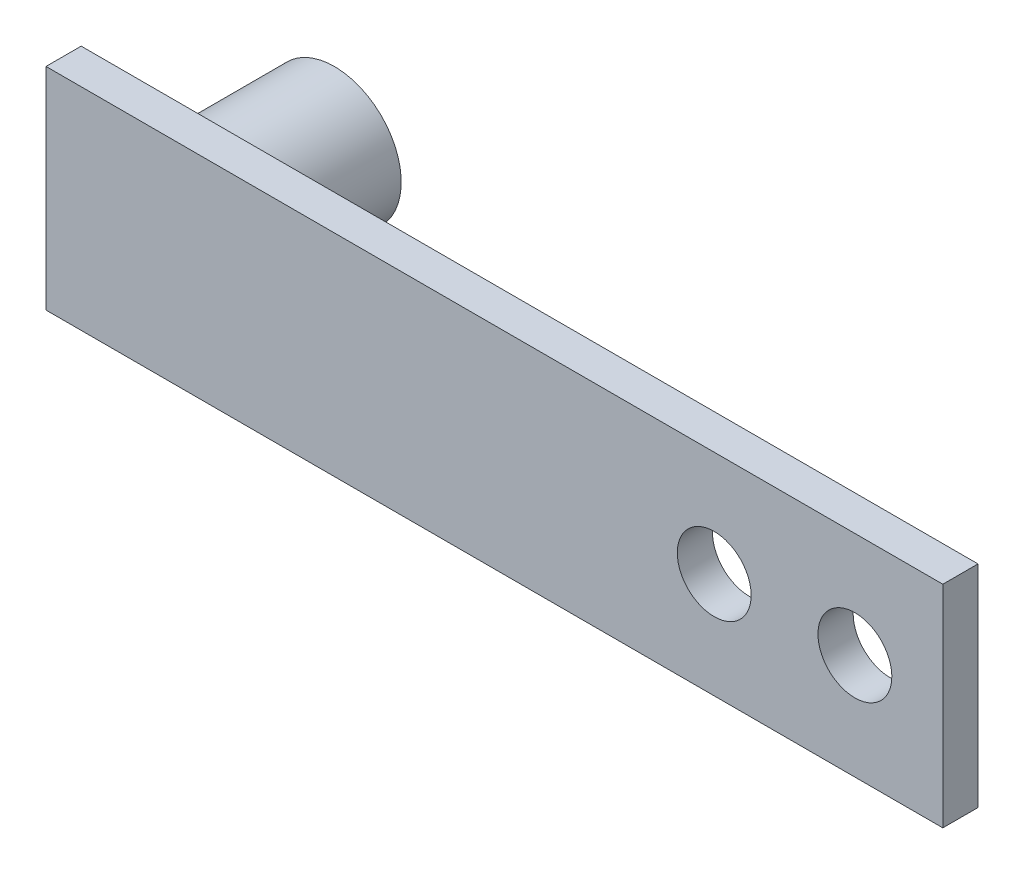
ISO-10303-21;
HEADER;
FILE_DESCRIPTION(('STEP AP214'),'2;1');
FILE_NAME('part.step','',(''),(''),'','','');
FILE_SCHEMA(('AUTOMOTIVE_DESIGN { 1 0 10303 214 1 1 1 1 }'));
ENDSEC;
DATA;
#1=APPLICATION_CONTEXT('core data for automotive mechanical design processes');
#2=APPLICATION_PROTOCOL_DEFINITION('international standard','automotive_design',2000,#1);
#3=PRODUCT_CONTEXT('',#1,'mechanical');
#4=PRODUCT('Part','Part','',(#3));
#5=PRODUCT_RELATED_PRODUCT_CATEGORY('part','',(#4));
#6=PRODUCT_DEFINITION_FORMATION('','',#4);
#7=PRODUCT_DEFINITION_CONTEXT('part definition',#1,'design');
#8=PRODUCT_DEFINITION('design','',#6,#7);
#9=PRODUCT_DEFINITION_SHAPE('','',#8);
#10=(LENGTH_UNIT() NAMED_UNIT(*) SI_UNIT(.MILLI.,.METRE.));
#11=(NAMED_UNIT(*) PLANE_ANGLE_UNIT() SI_UNIT($,.RADIAN.));
#12=(NAMED_UNIT(*) SI_UNIT($,.STERADIAN.) SOLID_ANGLE_UNIT());
#13=UNCERTAINTY_MEASURE_WITH_UNIT(LENGTH_MEASURE(1.E-05),#10,'distance_accuracy_value','');
#14=(GEOMETRIC_REPRESENTATION_CONTEXT(3) GLOBAL_UNCERTAINTY_ASSIGNED_CONTEXT((#13)) GLOBAL_UNIT_ASSIGNED_CONTEXT((#10,
#11,#12)) REPRESENTATION_CONTEXT('',''));
#15=CARTESIAN_POINT('',(0.,0.,0.));
#16=DIRECTION('',(0.,0.,1.));
#17=DIRECTION('',(1.,0.,0.));
#18=AXIS2_PLACEMENT_3D('',#15,#16,#17);
#19=CARTESIAN_POINT('',(0.,0.,20.));
#20=DIRECTION('',(0.,0.,-1.));
#21=DIRECTION('',(-1.,0.,0.));
#22=AXIS2_PLACEMENT_3D('',#19,#20,#21);
#23=PLANE('',#22);
#24=CARTESIAN_POINT('',(0.,0.,20.));
#25=DIRECTION('',(0.,0.,-1.));
#26=DIRECTION('',(-1.,0.,0.));
#27=AXIS2_PLACEMENT_3D('',#24,#25,#26);
#28=CIRCLE('',#27,9.5);
#29=CARTESIAN_POINT('',(-9.5,0.,20.));
#30=VERTEX_POINT('',#29);
#31=CARTESIAN_POINT('',(0.,9.5,20.));
#32=VERTEX_POINT('',#31);
#33=EDGE_CURVE('E25',#30,#32,#28,.T.);
#34=ORIENTED_EDGE('',*,*,#33,.F.);
#35=DIRECTION('',(0.,-1.,0.));
#36=VECTOR('',#35,1.);
#37=CARTESIAN_POINT('',(-9.5,9.5,20.));
#38=LINE('',#37,#36);
#39=CARTESIAN_POINT('',(-9.5,9.5,20.));
#40=VERTEX_POINT('',#39);
#41=EDGE_CURVE('E96',#40,#30,#38,.T.);
#42=ORIENTED_EDGE('',*,*,#41,.F.);
#43=DIRECTION('',(-1.,0.,0.));
#44=VECTOR('',#43,1.);
#45=CARTESIAN_POINT('',(9.5,9.5,20.));
#46=LINE('',#45,#44);
#47=EDGE_CURVE('E112',#32,#40,#46,.T.);
#48=ORIENTED_EDGE('',*,*,#47,.F.);
#49=EDGE_LOOP('',(#34,#42,#48));
#50=FACE_BOUND('',#49,.T.);
#51=ADVANCED_FACE('F14',(#50),#23,.T.);
#52=CARTESIAN_POINT('',(9.5,0.,20.));
#53=VERTEX_POINT('',#52);
#54=EDGE_CURVE('E9',#32,#53,#28,.T.);
#55=ORIENTED_EDGE('',*,*,#54,.F.);
#56=CARTESIAN_POINT('',(9.5,9.5,20.));
#57=VERTEX_POINT('',#56);
#58=EDGE_CURVE('E110',#57,#32,#46,.T.);
#59=ORIENTED_EDGE('',*,*,#58,.F.);
#60=DIRECTION('',(0.,1.,0.));
#61=VECTOR('',#60,1.);
#62=CARTESIAN_POINT('',(9.5,9.5,20.));
#63=LINE('',#62,#61);
#64=EDGE_CURVE('E175',#53,#57,#63,.T.);
#65=ORIENTED_EDGE('',*,*,#64,.F.);
#66=EDGE_LOOP('',(#55,#59,#65));
#67=FACE_BOUND('',#66,.T.);
#68=ADVANCED_FACE('F195',(#67),#23,.T.);
#69=CARTESIAN_POINT('',(0.,-9.5,20.));
#70=VERTEX_POINT('',#69);
#71=EDGE_CURVE('E23',#53,#70,#28,.T.);
#72=ORIENTED_EDGE('',*,*,#71,.F.);
#73=CARTESIAN_POINT('',(9.5,-9.5,20.));
#74=VERTEX_POINT('',#73);
#75=EDGE_CURVE('E163',#74,#53,#63,.T.);
#76=ORIENTED_EDGE('',*,*,#75,.F.);
#77=DIRECTION('',(1.,0.,0.));
#78=VECTOR('',#77,1.);
#79=CARTESIAN_POINT('',(9.5,-9.5,20.));
#80=LINE('',#79,#78);
#81=EDGE_CURVE('E104',#70,#74,#80,.T.);
#82=ORIENTED_EDGE('',*,*,#81,.F.);
#83=EDGE_LOOP('',(#72,#76,#82));
#84=FACE_BOUND('',#83,.T.);
#85=ADVANCED_FACE('F196',(#84),#23,.T.);
#86=CARTESIAN_POINT('',(9.5,9.5,21.));
#87=DIRECTION('',(0.,-1.,0.));
#88=DIRECTION('',(0.,0.,-1.));
#89=AXIS2_PLACEMENT_3D('',#86,#87,#88);
#90=PLANE('',#89);
#91=ORIENTED_EDGE('',*,*,#58,.T.);
#92=ORIENTED_EDGE('',*,*,#47,.T.);
#93=DIRECTION('',(0.,0.,-1.));
#94=VECTOR('',#93,1.);
#95=CARTESIAN_POINT('',(-9.5,9.5,21.));
#96=LINE('',#95,#94);
#97=CARTESIAN_POINT('',(-9.5,9.5,21.));
#98=VERTEX_POINT('',#97);
#99=EDGE_CURVE('E100',#98,#40,#96,.T.);
#100=ORIENTED_EDGE('',*,*,#99,.F.);
#101=DIRECTION('',(-1.,0.,0.));
#102=VECTOR('',#101,1.);
#103=CARTESIAN_POINT('',(9.5,9.5,21.));
#104=LINE('',#103,#102);
#105=CARTESIAN_POINT('',(9.5,9.5,21.));
#106=VERTEX_POINT('',#105);
#107=EDGE_CURVE('E159',#106,#98,#104,.T.);
#108=ORIENTED_EDGE('',*,*,#107,.F.);
#109=DIRECTION('',(0.,0.,-1.));
#110=VECTOR('',#109,1.);
#111=CARTESIAN_POINT('',(9.5,9.5,21.));
#112=LINE('',#111,#110);
#113=EDGE_CURVE('E172',#106,#57,#112,.T.);
#114=ORIENTED_EDGE('',*,*,#113,.T.);
#115=EDGE_LOOP('',(#91,#92,#100,#108,#114));
#116=FACE_BOUND('',#115,.T.);
#117=ADVANCED_FACE('F16',(#116),#90,.F.);
#118=CARTESIAN_POINT('',(-9.5,9.5,21.));
#119=DIRECTION('',(1.,0.,0.));
#120=DIRECTION('',(0.,0.,1.));
#121=AXIS2_PLACEMENT_3D('',#118,#119,#120);
#122=PLANE('',#121);
#123=ORIENTED_EDGE('',*,*,#41,.T.);
#124=CARTESIAN_POINT('',(-9.5,-9.5,20.));
#125=VERTEX_POINT('',#124);
#126=EDGE_CURVE('E98',#30,#125,#38,.T.);
#127=ORIENTED_EDGE('',*,*,#126,.T.);
#128=DIRECTION('',(0.,0.,-1.));
#129=VECTOR('',#128,1.);
#130=CARTESIAN_POINT('',(-9.5,-9.5,21.));
#131=LINE('',#130,#129);
#132=CARTESIAN_POINT('',(-9.5,-9.5,21.));
#133=VERTEX_POINT('',#132);
#134=EDGE_CURVE('E117',#133,#125,#131,.T.);
#135=ORIENTED_EDGE('',*,*,#134,.F.);
#136=DIRECTION('',(0.,-1.,0.));
#137=VECTOR('',#136,1.);
#138=CARTESIAN_POINT('',(-9.5,9.5,21.));
#139=LINE('',#138,#137);
#140=EDGE_CURVE('E162',#98,#133,#139,.T.);
#141=ORIENTED_EDGE('',*,*,#140,.F.);
#142=ORIENTED_EDGE('',*,*,#99,.T.);
#143=EDGE_LOOP('',(#123,#127,#135,#141,#142));
#144=FACE_BOUND('',#143,.T.);
#145=ADVANCED_FACE('F97',(#144),#122,.F.);
#146=CARTESIAN_POINT('',(9.5,-9.5,21.));
#147=DIRECTION('',(0.,1.,0.));
#148=DIRECTION('',(-1.,0.,0.));
#149=AXIS2_PLACEMENT_3D('',#146,#147,#148);
#150=PLANE('',#149);
#151=EDGE_CURVE('E108',#125,#70,#80,.T.);
#152=ORIENTED_EDGE('',*,*,#151,.T.);
#153=ORIENTED_EDGE('',*,*,#81,.T.);
#154=DIRECTION('',(0.,0.,-1.));
#155=VECTOR('',#154,1.);
#156=CARTESIAN_POINT('',(9.5,-9.5,21.));
#157=LINE('',#156,#155);
#158=CARTESIAN_POINT('',(9.5,-9.5,21.));
#159=VERTEX_POINT('',#158);
#160=EDGE_CURVE('E180',#159,#74,#157,.T.);
#161=ORIENTED_EDGE('',*,*,#160,.F.);
#162=DIRECTION('',(1.,0.,0.));
#163=VECTOR('',#162,1.);
#164=CARTESIAN_POINT('',(9.5,-9.5,21.));
#165=LINE('',#164,#163);
#166=EDGE_CURVE('E166',#133,#159,#165,.T.);
#167=ORIENTED_EDGE('',*,*,#166,.F.);
#168=ORIENTED_EDGE('',*,*,#134,.T.);
#169=EDGE_LOOP('',(#152,#153,#161,#167,#168));
#170=FACE_BOUND('',#169,.T.);
#171=ADVANCED_FACE('F185',(#170),#150,.F.);
#172=CARTESIAN_POINT('',(9.5,9.5,21.));
#173=DIRECTION('',(-1.,0.,0.));
#174=DIRECTION('',(0.,-1.,0.));
#175=AXIS2_PLACEMENT_3D('',#172,#173,#174);
#176=PLANE('',#175);
#177=ORIENTED_EDGE('',*,*,#75,.T.);
#178=ORIENTED_EDGE('',*,*,#64,.T.);
#179=ORIENTED_EDGE('',*,*,#113,.F.);
#180=DIRECTION('',(0.,1.,0.));
#181=VECTOR('',#180,1.);
#182=CARTESIAN_POINT('',(9.5,9.5,21.));
#183=LINE('',#182,#181);
#184=EDGE_CURVE('E169',#159,#106,#183,.T.);
#185=ORIENTED_EDGE('',*,*,#184,.F.);
#186=ORIENTED_EDGE('',*,*,#160,.T.);
#187=EDGE_LOOP('',(#177,#178,#179,#185,#186));
#188=FACE_BOUND('',#187,.T.);
#189=ADVANCED_FACE('F192',(#188),#176,.F.);
#190=CARTESIAN_POINT('',(-15.,15.,21.));
#191=DIRECTION('',(0.,0.,1.));
#192=DIRECTION('',(0.,-1.,0.));
#193=AXIS2_PLACEMENT_3D('',#190,#191,#192);
#194=PLANE('',#193);
#195=CARTESIAN_POINT('',(80.,0.,21.));
#196=DIRECTION('',(0.,0.,1.));
#197=DIRECTION('',(0.,-1.,0.));
#198=AXIS2_PLACEMENT_3D('',#195,#196,#197);
#199=CIRCLE('',#198,5.25);
#200=CARTESIAN_POINT('',(80.,-5.25,21.));
#201=VERTEX_POINT('',#200);
#202=EDGE_CURVE('E123',#201,#201,#199,.T.);
#203=ORIENTED_EDGE('',*,*,#202,.T.);
#204=EDGE_LOOP('',(#203));
#205=FACE_BOUND('',#204,.T.);
#206=CARTESIAN_POINT('',(100.,0.,21.));
#207=DIRECTION('',(0.,0.,1.));
#208=DIRECTION('',(0.,-1.,0.));
#209=AXIS2_PLACEMENT_3D('',#206,#207,#208);
#210=CIRCLE('',#209,5.25);
#211=CARTESIAN_POINT('',(100.,-5.25,21.));
#212=VERTEX_POINT('',#211);
#213=EDGE_CURVE('E18',#212,#212,#210,.T.);
#214=ORIENTED_EDGE('',*,*,#213,.T.);
#215=EDGE_LOOP('',(#214));
#216=FACE_BOUND('',#215,.T.);
#217=DIRECTION('',(-1.,0.,0.));
#218=VECTOR('',#217,1.);
#219=CARTESIAN_POINT('',(112.5,15.,21.));
#220=LINE('',#219,#218);
#221=CARTESIAN_POINT('',(112.5,15.,21.));
#222=VERTEX_POINT('',#221);
#223=CARTESIAN_POINT('',(-15.,15.,21.));
#224=VERTEX_POINT('',#223);
#225=EDGE_CURVE('E140',#222,#224,#220,.T.);
#226=ORIENTED_EDGE('',*,*,#225,.F.);
#227=DIRECTION('',(0.,1.,0.));
#228=VECTOR('',#227,1.);
#229=CARTESIAN_POINT('',(112.5,15.,21.));
#230=LINE('',#229,#228);
#231=CARTESIAN_POINT('',(112.5,-15.,21.));
#232=VERTEX_POINT('',#231);
#233=EDGE_CURVE('E133',#232,#222,#230,.T.);
#234=ORIENTED_EDGE('',*,*,#233,.F.);
#235=DIRECTION('',(1.,0.,0.));
#236=VECTOR('',#235,1.);
#237=CARTESIAN_POINT('',(112.5,-15.,21.));
#238=LINE('',#237,#236);
#239=CARTESIAN_POINT('',(-15.,-15.,21.));
#240=VERTEX_POINT('',#239);
#241=EDGE_CURVE('E145',#240,#232,#238,.T.);
#242=ORIENTED_EDGE('',*,*,#241,.F.);
#243=DIRECTION('',(0.,-1.,0.));
#244=VECTOR('',#243,1.);
#245=CARTESIAN_POINT('',(-15.,15.,21.));
#246=LINE('',#245,#244);
#247=EDGE_CURVE('E143',#224,#240,#246,.T.);
#248=ORIENTED_EDGE('',*,*,#247,.F.);
#249=EDGE_LOOP('',(#226,#234,#242,#248));
#250=FACE_BOUND('',#249,.T.);
#251=ORIENTED_EDGE('',*,*,#184,.T.);
#252=ORIENTED_EDGE('',*,*,#107,.T.);
#253=ORIENTED_EDGE('',*,*,#140,.T.);
#254=ORIENTED_EDGE('',*,*,#166,.T.);
#255=EDGE_LOOP('',(#251,#252,#253,#254));
#256=FACE_BOUND('',#255,.T.);
#257=ADVANCED_FACE('F189',(#205,#216,#250,#256),#194,.F.);
#258=CARTESIAN_POINT('',(112.5,15.,26.));
#259=DIRECTION('',(0.,-1.,0.));
#260=DIRECTION('',(1.,0.,0.));
#261=AXIS2_PLACEMENT_3D('',#258,#259,#260);
#262=PLANE('',#261);
#263=ORIENTED_EDGE('',*,*,#225,.T.);
#264=DIRECTION('',(0.,0.,-1.));
#265=VECTOR('',#264,1.);
#266=CARTESIAN_POINT('',(-15.,15.,26.));
#267=LINE('',#266,#265);
#268=CARTESIAN_POINT('',(-15.,15.,26.));
#269=VERTEX_POINT('',#268);
#270=EDGE_CURVE('E156',#269,#224,#267,.T.);
#271=ORIENTED_EDGE('',*,*,#270,.F.);
#272=DIRECTION('',(-1.,0.,0.));
#273=VECTOR('',#272,1.);
#274=CARTESIAN_POINT('',(112.5,15.,26.));
#275=LINE('',#274,#273);
#276=CARTESIAN_POINT('',(112.5,15.,26.));
#277=VERTEX_POINT('',#276);
#278=EDGE_CURVE('E129',#277,#269,#275,.T.);
#279=ORIENTED_EDGE('',*,*,#278,.F.);
#280=DIRECTION('',(0.,0.,-1.));
#281=VECTOR('',#280,1.);
#282=CARTESIAN_POINT('',(112.5,15.,26.));
#283=LINE('',#282,#281);
#284=EDGE_CURVE('E139',#277,#222,#283,.T.);
#285=ORIENTED_EDGE('',*,*,#284,.T.);
#286=EDGE_LOOP('',(#263,#271,#279,#285));
#287=FACE_BOUND('',#286,.T.);
#288=ADVANCED_FACE('F308',(#287),#262,.F.);
#289=CARTESIAN_POINT('',(-15.,15.,26.));
#290=DIRECTION('',(1.,0.,0.));
#291=DIRECTION('',(0.,1.,0.));
#292=AXIS2_PLACEMENT_3D('',#289,#290,#291);
#293=PLANE('',#292);
#294=ORIENTED_EDGE('',*,*,#247,.T.);
#295=DIRECTION('',(0.,0.,-1.));
#296=VECTOR('',#295,1.);
#297=CARTESIAN_POINT('',(-15.,-15.,26.));
#298=LINE('',#297,#296);
#299=CARTESIAN_POINT('',(-15.,-15.,26.));
#300=VERTEX_POINT('',#299);
#301=EDGE_CURVE('E153',#300,#240,#298,.T.);
#302=ORIENTED_EDGE('',*,*,#301,.F.);
#303=DIRECTION('',(0.,-1.,0.));
#304=VECTOR('',#303,1.);
#305=CARTESIAN_POINT('',(-15.,15.,26.));
#306=LINE('',#305,#304);
#307=EDGE_CURVE('E132',#269,#300,#306,.T.);
#308=ORIENTED_EDGE('',*,*,#307,.F.);
#309=ORIENTED_EDGE('',*,*,#270,.T.);
#310=EDGE_LOOP('',(#294,#302,#308,#309));
#311=FACE_BOUND('',#310,.T.);
#312=ADVANCED_FACE('F298',(#311),#293,.F.);
#313=CARTESIAN_POINT('',(112.5,-15.,26.));
#314=DIRECTION('',(0.,1.,0.));
#315=DIRECTION('',(-1.,0.,0.));
#316=AXIS2_PLACEMENT_3D('',#313,#314,#315);
#317=PLANE('',#316);
#318=ORIENTED_EDGE('',*,*,#241,.T.);
#319=DIRECTION('',(0.,0.,-1.));
#320=VECTOR('',#319,1.);
#321=CARTESIAN_POINT('',(112.5,-15.,26.));
#322=LINE('',#321,#320);
#323=CARTESIAN_POINT('',(112.5,-15.,26.));
#324=VERTEX_POINT('',#323);
#325=EDGE_CURVE('E150',#324,#232,#322,.T.);
#326=ORIENTED_EDGE('',*,*,#325,.F.);
#327=DIRECTION('',(1.,0.,0.));
#328=VECTOR('',#327,1.);
#329=CARTESIAN_POINT('',(112.5,-15.,26.));
#330=LINE('',#329,#328);
#331=EDGE_CURVE('E135',#300,#324,#330,.T.);
#332=ORIENTED_EDGE('',*,*,#331,.F.);
#333=ORIENTED_EDGE('',*,*,#301,.T.);
#334=EDGE_LOOP('',(#318,#326,#332,#333));
#335=FACE_BOUND('',#334,.T.);
#336=ADVANCED_FACE('F288',(#335),#317,.F.);
#337=CARTESIAN_POINT('',(112.5,15.,26.));
#338=DIRECTION('',(-1.,0.,0.));
#339=DIRECTION('',(0.,0.,-1.));
#340=AXIS2_PLACEMENT_3D('',#337,#338,#339);
#341=PLANE('',#340);
#342=ORIENTED_EDGE('',*,*,#233,.T.);
#343=ORIENTED_EDGE('',*,*,#284,.F.);
#344=DIRECTION('',(0.,1.,0.));
#345=VECTOR('',#344,1.);
#346=CARTESIAN_POINT('',(112.5,15.,26.));
#347=LINE('',#346,#345);
#348=EDGE_CURVE('E137',#324,#277,#347,.T.);
#349=ORIENTED_EDGE('',*,*,#348,.F.);
#350=ORIENTED_EDGE('',*,*,#325,.T.);
#351=EDGE_LOOP('',(#342,#343,#349,#350));
#352=FACE_BOUND('',#351,.T.);
#353=ADVANCED_FACE('F278',(#352),#341,.F.);
#354=CARTESIAN_POINT('',(-15.,15.,26.));
#355=DIRECTION('',(0.,0.,1.));
#356=DIRECTION('',(0.,-1.,0.));
#357=AXIS2_PLACEMENT_3D('',#354,#355,#356);
#358=PLANE('',#357);
#359=CARTESIAN_POINT('',(80.,0.,26.));
#360=DIRECTION('',(0.,0.,1.));
#361=DIRECTION('',(0.,-1.,0.));
#362=AXIS2_PLACEMENT_3D('',#359,#360,#361);
#363=CIRCLE('',#362,5.25);
#364=CARTESIAN_POINT('',(80.,-5.25,26.));
#365=VERTEX_POINT('',#364);
#366=EDGE_CURVE('E120',#365,#365,#363,.T.);
#367=ORIENTED_EDGE('',*,*,#366,.F.);
#368=EDGE_LOOP('',(#367));
#369=FACE_BOUND('',#368,.T.);
#370=CARTESIAN_POINT('',(100.,0.,26.));
#371=DIRECTION('',(0.,0.,1.));
#372=DIRECTION('',(0.,-1.,0.));
#373=AXIS2_PLACEMENT_3D('',#370,#371,#372);
#374=CIRCLE('',#373,5.25);
#375=CARTESIAN_POINT('',(100.,-5.25,26.));
#376=VERTEX_POINT('',#375);
#377=EDGE_CURVE('E126',#376,#376,#374,.T.);
#378=ORIENTED_EDGE('',*,*,#377,.F.);
#379=EDGE_LOOP('',(#378));
#380=FACE_BOUND('',#379,.T.);
#381=ORIENTED_EDGE('',*,*,#278,.T.);
#382=ORIENTED_EDGE('',*,*,#307,.T.);
#383=ORIENTED_EDGE('',*,*,#331,.T.);
#384=ORIENTED_EDGE('',*,*,#348,.T.);
#385=EDGE_LOOP('',(#381,#382,#383,#384));
#386=FACE_BOUND('',#385,.T.);
#387=ADVANCED_FACE('F268',(#369,#380,#386),#358,.T.);
#388=CARTESIAN_POINT('',(100.,0.,26.));
#389=DIRECTION('',(0.,0.,1.));
#390=DIRECTION('',(0.,-1.,0.));
#391=AXIS2_PLACEMENT_3D('',#388,#389,#390);
#392=CYLINDRICAL_SURFACE('',#391,5.25);
#393=ORIENTED_EDGE('',*,*,#377,.T.);
#394=EDGE_LOOP('',(#393));
#395=FACE_BOUND('',#394,.T.);
#396=ORIENTED_EDGE('',*,*,#213,.F.);
#397=EDGE_LOOP('',(#396));
#398=FACE_BOUND('',#397,.T.);
#399=ADVANCED_FACE('F262',(#395,#398),#392,.F.);
#400=CARTESIAN_POINT('',(80.,0.,26.));
#401=DIRECTION('',(0.,0.,1.));
#402=DIRECTION('',(0.,-1.,0.));
#403=AXIS2_PLACEMENT_3D('',#400,#401,#402);
#404=CYLINDRICAL_SURFACE('',#403,5.25);
#405=ORIENTED_EDGE('',*,*,#366,.T.);
#406=EDGE_LOOP('',(#405));
#407=FACE_BOUND('',#406,.T.);
#408=ORIENTED_EDGE('',*,*,#202,.F.);
#409=EDGE_LOOP('',(#408));
#410=FACE_BOUND('',#409,.T.);
#411=ADVANCED_FACE('F208',(#407,#410),#404,.F.);
#412=EDGE_CURVE('E32',#70,#30,#28,.T.);
#413=ORIENTED_EDGE('',*,*,#412,.F.);
#414=ORIENTED_EDGE('',*,*,#151,.F.);
#415=ORIENTED_EDGE('',*,*,#126,.F.);
#416=EDGE_LOOP('',(#413,#414,#415));
#417=FACE_BOUND('',#416,.T.);
#418=ADVANCED_FACE('F106',(#417),#23,.T.);
#419=CARTESIAN_POINT('',(0.,0.,0.));
#420=DIRECTION('',(0.,0.,1.));
#421=DIRECTION('',(1.,0.,0.));
#422=AXIS2_PLACEMENT_3D('',#419,#420,#421);
#423=CYLINDRICAL_SURFACE('',#422,9.5);
#424=CARTESIAN_POINT('',(0.,0.,0.));
#425=DIRECTION('',(0.,0.,-1.));
#426=DIRECTION('',(-1.,0.,0.));
#427=AXIS2_PLACEMENT_3D('',#424,#425,#426);
#428=CIRCLE('',#427,9.5);
#429=CARTESIAN_POINT('',(-9.5,0.,0.));
#430=VERTEX_POINT('',#429);
#431=EDGE_CURVE('E115',#430,#430,#428,.T.);
#432=ORIENTED_EDGE('',*,*,#431,.F.);
#433=EDGE_LOOP('',(#432));
#434=FACE_BOUND('',#433,.T.);
#435=ORIENTED_EDGE('',*,*,#33,.T.);
#436=ORIENTED_EDGE('',*,*,#54,.T.);
#437=ORIENTED_EDGE('',*,*,#71,.T.);
#438=ORIENTED_EDGE('',*,*,#412,.T.);
#439=EDGE_LOOP('',(#435,#436,#437,#438));
#440=FACE_BOUND('',#439,.T.);
#441=ADVANCED_FACE('F116',(#434,#440),#423,.T.);
#442=CARTESIAN_POINT('',(0.,0.,0.));
#443=DIRECTION('',(0.,0.,-1.));
#444=DIRECTION('',(-1.,0.,0.));
#445=AXIS2_PLACEMENT_3D('',#442,#443,#444);
#446=PLANE('',#445);
#447=ORIENTED_EDGE('',*,*,#431,.T.);
#448=EDGE_LOOP('',(#447));
#449=FACE_BOUND('',#448,.T.);
#450=ADVANCED_FACE('F249',(#449),#446,.T.);
#451=CLOSED_SHELL('',(#51,#68,#85,#117,#145,#171,#189,#257,#288,#312,#336,#353,#387,#399,#411,
#418,#441,#450));
#452=MANIFOLD_SOLID_BREP('B1',#451);
#453=ADVANCED_BREP_SHAPE_REPRESENTATION('',(#18,#452),#14);
#454=SHAPE_DEFINITION_REPRESENTATION(#9,#453);
ENDSEC;
END-ISO-10303-21;
